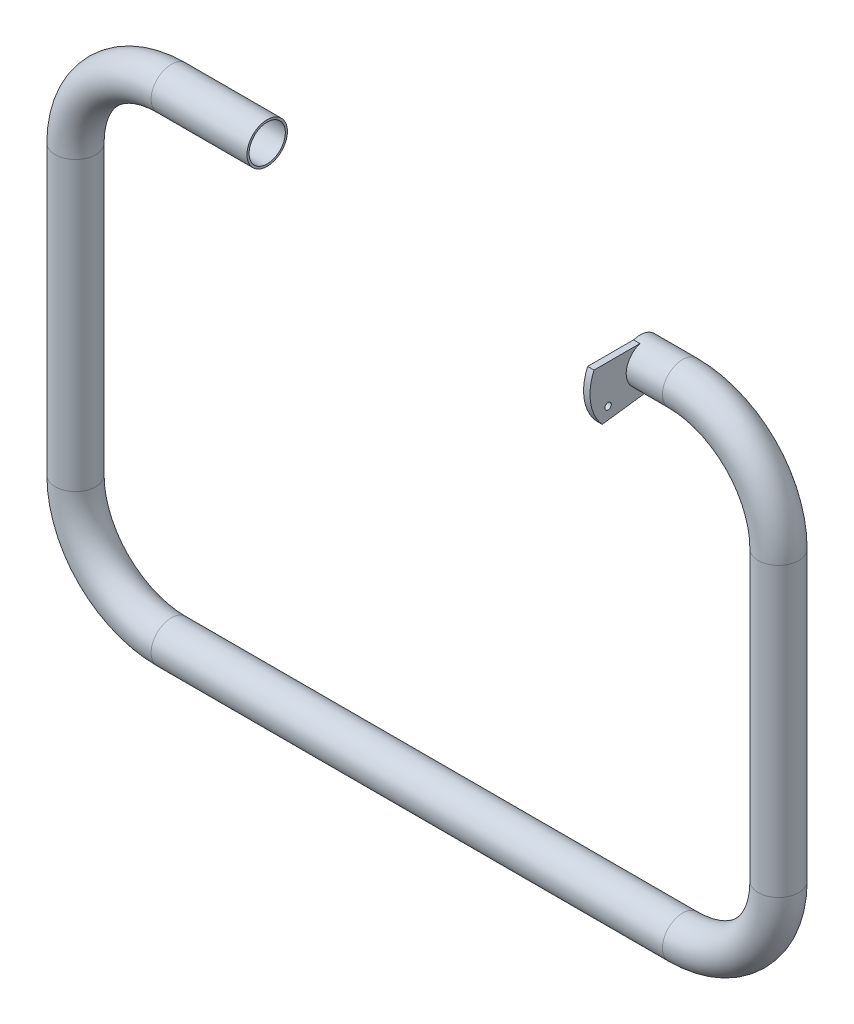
ISO-10303-21;
HEADER;
FILE_DESCRIPTION(('STEP AP214'),'2;1');
FILE_NAME('part.step','',(''),(''),'','','');
FILE_SCHEMA(('AUTOMOTIVE_DESIGN { 1 0 10303 214 1 1 1 1 }'));
ENDSEC;
DATA;
#1=APPLICATION_CONTEXT('core data for automotive mechanical design processes');
#2=APPLICATION_PROTOCOL_DEFINITION('international standard','automotive_design',2000,#1);
#3=PRODUCT_CONTEXT('',#1,'mechanical');
#4=PRODUCT('Part','Part','',(#3));
#5=PRODUCT_RELATED_PRODUCT_CATEGORY('part','',(#4));
#6=PRODUCT_DEFINITION_FORMATION('','',#4);
#7=PRODUCT_DEFINITION_CONTEXT('part definition',#1,'design');
#8=PRODUCT_DEFINITION('design','',#6,#7);
#9=PRODUCT_DEFINITION_SHAPE('','',#8);
#10=(LENGTH_UNIT() NAMED_UNIT(*) SI_UNIT(.MILLI.,.METRE.));
#11=(NAMED_UNIT(*) PLANE_ANGLE_UNIT() SI_UNIT($,.RADIAN.));
#12=(NAMED_UNIT(*) SI_UNIT($,.STERADIAN.) SOLID_ANGLE_UNIT());
#13=UNCERTAINTY_MEASURE_WITH_UNIT(LENGTH_MEASURE(1.E-05),#10,'distance_accuracy_value','');
#14=(GEOMETRIC_REPRESENTATION_CONTEXT(3) GLOBAL_UNCERTAINTY_ASSIGNED_CONTEXT((#13)) GLOBAL_UNIT_ASSIGNED_CONTEXT((#10,
#11,#12)) REPRESENTATION_CONTEXT('',''));
#15=CARTESIAN_POINT('',(0.,0.,0.));
#16=DIRECTION('',(0.,0.,1.));
#17=DIRECTION('',(1.,0.,0.));
#18=AXIS2_PLACEMENT_3D('',#15,#16,#17);
#19=CARTESIAN_POINT('',(-440.,0.,0.));
#20=DIRECTION('',(1.,0.,0.));
#21=DIRECTION('',(0.,1.,0.));
#22=AXIS2_PLACEMENT_3D('',#19,#20,#21);
#23=CYLINDRICAL_SURFACE('',#22,19.);
#24=CARTESIAN_POINT('',(-440.,0.,0.));
#25=DIRECTION('',(1.,0.,0.));
#26=DIRECTION('',(0.,1.,0.));
#27=AXIS2_PLACEMENT_3D('',#24,#25,#26);
#28=CIRCLE('',#27,19.);
#29=CARTESIAN_POINT('',(-440.,18.9999999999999,0.));
#30=VERTEX_POINT('',#29);
#31=EDGE_CURVE('E169',#30,#30,#28,.T.);
#32=ORIENTED_EDGE('',*,*,#31,.T.);
#33=EDGE_LOOP('',(#32));
#34=FACE_BOUND('',#33,.T.);
#35=CARTESIAN_POINT('',(-350.,0.,0.));
#36=DIRECTION('',(1.,0.,0.));
#37=DIRECTION('',(0.,1.,0.));
#38=AXIS2_PLACEMENT_3D('',#35,#36,#37);
#39=CIRCLE('',#38,19.);
#40=CARTESIAN_POINT('',(-350.,19.,0.));
#41=VERTEX_POINT('',#40);
#42=EDGE_CURVE('E41',#41,#41,#39,.T.);
#43=ORIENTED_EDGE('',*,*,#42,.F.);
#44=EDGE_LOOP('',(#43));
#45=FACE_BOUND('',#44,.T.);
#46=ADVANCED_FACE('F33',(#34,#45),#23,.T.);
#47=CARTESIAN_POINT('',(-440.,-90.,0.));
#48=DIRECTION('',(0.,0.,-1.));
#49=DIRECTION('',(-1.,0.,0.));
#50=AXIS2_PLACEMENT_3D('',#47,#48,#49);
#51=TOROIDAL_SURFACE('',#50,90.,19.);
#52=CARTESIAN_POINT('',(-530.000000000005,-90.0000000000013,0.));
#53=DIRECTION('',(0.,-1.,0.));
#54=DIRECTION('',(0.,0.,-1.));
#55=AXIS2_PLACEMENT_3D('',#52,#53,#54);
#56=CIRCLE('',#55,19.);
#57=CARTESIAN_POINT('',(-549.,-90.0000000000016,0.));
#58=VERTEX_POINT('',#57);
#59=EDGE_CURVE('E172',#58,#58,#56,.F.);
#60=CARTESIAN_POINT('',(-440.,-90.,0.));
#61=DIRECTION('',(0.,0.,-1.));
#62=DIRECTION('',(-1.,0.,0.));
#63=AXIS2_PLACEMENT_3D('',#60,#61,#62);
#64=CIRCLE('',#63,109.);
#65=EDGE_CURVE('',#58,#30,#64,.T.);
#66=ORIENTED_EDGE('',*,*,#59,.T.);
#67=ORIENTED_EDGE('',*,*,#31,.F.);
#68=ORIENTED_EDGE('',*,*,#65,.T.);
#69=ORIENTED_EDGE('',*,*,#65,.F.);
#70=EDGE_LOOP('',(#66,#68,#67,#69));
#71=FACE_BOUND('',#70,.T.);
#72=ADVANCED_FACE('F223',(#71),#51,.T.);
#73=CARTESIAN_POINT('',(-530.000000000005,-360.000000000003,0.));
#74=DIRECTION('',(0.,1.,0.));
#75=DIRECTION('',(-1.,0.,0.));
#76=AXIS2_PLACEMENT_3D('',#73,#74,#75);
#77=CYLINDRICAL_SURFACE('',#76,19.);
#78=CARTESIAN_POINT('',(-530.000000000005,-360.000000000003,0.));
#79=DIRECTION('',(0.,1.,0.));
#80=DIRECTION('',(-1.,0.,0.));
#81=AXIS2_PLACEMENT_3D('',#78,#79,#80);
#82=CIRCLE('',#81,19.);
#83=CARTESIAN_POINT('',(-549.,-360.000000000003,0.));
#84=VERTEX_POINT('',#83);
#85=EDGE_CURVE('E175',#84,#84,#82,.T.);
#86=ORIENTED_EDGE('',*,*,#85,.T.);
#87=EDGE_LOOP('',(#86));
#88=FACE_BOUND('',#87,.T.);
#89=ORIENTED_EDGE('',*,*,#59,.F.);
#90=EDGE_LOOP('',(#89));
#91=FACE_BOUND('',#90,.T.);
#92=ADVANCED_FACE('F229',(#88,#91),#77,.T.);
#93=CARTESIAN_POINT('',(-440.,-360.,0.));
#94=DIRECTION('',(0.,0.,-1.));
#95=DIRECTION('',(-1.,0.,0.));
#96=AXIS2_PLACEMENT_3D('',#93,#94,#95);
#97=TOROIDAL_SURFACE('',#96,90.,19.);
#98=CARTESIAN_POINT('',(-440.,-450.,0.));
#99=DIRECTION('',(1.,0.,0.));
#100=DIRECTION('',(0.,1.,0.));
#101=AXIS2_PLACEMENT_3D('',#98,#99,#100);
#102=CIRCLE('',#101,19.);
#103=CARTESIAN_POINT('',(-440.,-469.,0.));
#104=VERTEX_POINT('',#103);
#105=EDGE_CURVE('E178',#104,#104,#102,.F.);
#106=CARTESIAN_POINT('',(-440.,-360.,0.));
#107=DIRECTION('',(0.,0.,-1.));
#108=DIRECTION('',(-1.,0.,0.));
#109=AXIS2_PLACEMENT_3D('',#106,#107,#108);
#110=CIRCLE('',#109,109.);
#111=EDGE_CURVE('',#104,#84,#110,.T.);
#112=ORIENTED_EDGE('',*,*,#105,.T.);
#113=ORIENTED_EDGE('',*,*,#85,.F.);
#114=ORIENTED_EDGE('',*,*,#111,.T.);
#115=ORIENTED_EDGE('',*,*,#111,.F.);
#116=EDGE_LOOP('',(#112,#114,#113,#115));
#117=FACE_BOUND('',#116,.T.);
#118=ADVANCED_FACE('F239',(#117),#97,.T.);
#119=CARTESIAN_POINT('',(40.,-450.,3.46944695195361E-13));
#120=DIRECTION('',(-1.,0.,0.));
#121=DIRECTION('',(0.,-1.,0.));
#122=AXIS2_PLACEMENT_3D('',#119,#120,#121);
#123=CYLINDRICAL_SURFACE('',#122,19.);
#124=CARTESIAN_POINT('',(40.,-450.,3.46944695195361E-13));
#125=DIRECTION('',(-1.,0.,0.));
#126=DIRECTION('',(0.,-1.,0.));
#127=AXIS2_PLACEMENT_3D('',#124,#125,#126);
#128=CIRCLE('',#127,19.);
#129=CARTESIAN_POINT('',(40.0000000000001,-469.,3.52804205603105E-13));
#130=VERTEX_POINT('',#129);
#131=EDGE_CURVE('E181',#130,#130,#128,.T.);
#132=ORIENTED_EDGE('',*,*,#131,.T.);
#133=EDGE_LOOP('',(#132));
#134=FACE_BOUND('',#133,.T.);
#135=ORIENTED_EDGE('',*,*,#105,.F.);
#136=EDGE_LOOP('',(#135));
#137=FACE_BOUND('',#136,.T.);
#138=ADVANCED_FACE('F243',(#134,#137),#123,.T.);
#139=CARTESIAN_POINT('',(39.9999999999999,-360.,3.19189119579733E-13));
#140=DIRECTION('',(0.,0.,-1.));
#141=DIRECTION('',(-1.,0.,0.));
#142=AXIS2_PLACEMENT_3D('',#139,#140,#141);
#143=TOROIDAL_SURFACE('',#142,90.,19.);
#144=CARTESIAN_POINT('',(130.,-360.000000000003,3.46944695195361E-13));
#145=DIRECTION('',(0.,1.,0.));
#146=DIRECTION('',(-1.,0.,0.));
#147=AXIS2_PLACEMENT_3D('',#144,#145,#146);
#148=CIRCLE('',#147,19.);
#149=CARTESIAN_POINT('',(149.,-360.000000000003,3.52804205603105E-13));
#150=VERTEX_POINT('',#149);
#151=EDGE_CURVE('E184',#150,#150,#148,.F.);
#152=CARTESIAN_POINT('',(39.9999999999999,-360.,3.19189119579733E-13));
#153=DIRECTION('',(0.,0.,-1.));
#154=DIRECTION('',(-1.,0.,0.));
#155=AXIS2_PLACEMENT_3D('',#152,#153,#154);
#156=CIRCLE('',#155,109.);
#157=EDGE_CURVE('',#150,#130,#156,.T.);
#158=ORIENTED_EDGE('',*,*,#151,.T.);
#159=ORIENTED_EDGE('',*,*,#131,.F.);
#160=ORIENTED_EDGE('',*,*,#157,.T.);
#161=ORIENTED_EDGE('',*,*,#157,.F.);
#162=EDGE_LOOP('',(#158,#160,#159,#161));
#163=FACE_BOUND('',#162,.T.);
#164=ADVANCED_FACE('F247',(#163),#143,.T.);
#165=CARTESIAN_POINT('',(130.,-90.0000000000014,0.));
#166=DIRECTION('',(0.,-1.,0.));
#167=DIRECTION('',(1.,0.,0.));
#168=AXIS2_PLACEMENT_3D('',#165,#166,#167);
#169=CYLINDRICAL_SURFACE('',#168,19.);
#170=CARTESIAN_POINT('',(130.,-90.0000000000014,0.));
#171=DIRECTION('',(0.,-1.,0.));
#172=DIRECTION('',(1.,0.,0.));
#173=AXIS2_PLACEMENT_3D('',#170,#171,#172);
#174=CIRCLE('',#173,19.);
#175=CARTESIAN_POINT('',(149.,-90.0000000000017,0.));
#176=VERTEX_POINT('',#175);
#177=EDGE_CURVE('E187',#176,#176,#174,.T.);
#178=ORIENTED_EDGE('',*,*,#177,.T.);
#179=EDGE_LOOP('',(#178));
#180=FACE_BOUND('',#179,.T.);
#181=ORIENTED_EDGE('',*,*,#151,.F.);
#182=EDGE_LOOP('',(#181));
#183=FACE_BOUND('',#182,.T.);
#184=ADVANCED_FACE('F251',(#180,#183),#169,.T.);
#185=CARTESIAN_POINT('',(39.9999999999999,-90.,0.));
#186=DIRECTION('',(0.,0.,-1.));
#187=DIRECTION('',(-1.,0.,0.));
#188=AXIS2_PLACEMENT_3D('',#185,#186,#187);
#189=TOROIDAL_SURFACE('',#188,90.,19.);
#190=CARTESIAN_POINT('',(40.,0.,0.));
#191=DIRECTION('',(-1.,0.,0.));
#192=DIRECTION('',(0.,-1.,0.));
#193=AXIS2_PLACEMENT_3D('',#190,#191,#192);
#194=CIRCLE('',#193,19.);
#195=CARTESIAN_POINT('',(40.0000000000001,19.,0.));
#196=VERTEX_POINT('',#195);
#197=EDGE_CURVE('E190',#196,#196,#194,.F.);
#198=CARTESIAN_POINT('',(39.9999999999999,-90.,0.));
#199=DIRECTION('',(0.,0.,-1.));
#200=DIRECTION('',(-1.,0.,0.));
#201=AXIS2_PLACEMENT_3D('',#198,#199,#200);
#202=CIRCLE('',#201,109.);
#203=EDGE_CURVE('',#196,#176,#202,.T.);
#204=ORIENTED_EDGE('',*,*,#197,.T.);
#205=ORIENTED_EDGE('',*,*,#177,.F.);
#206=ORIENTED_EDGE('',*,*,#203,.T.);
#207=ORIENTED_EDGE('',*,*,#203,.F.);
#208=EDGE_LOOP('',(#204,#206,#205,#207));
#209=FACE_BOUND('',#208,.T.);
#210=ADVANCED_FACE('F254',(#209),#189,.T.);
#211=CARTESIAN_POINT('',(40.,0.,0.));
#212=DIRECTION('',(-1.,0.,0.));
#213=DIRECTION('',(0.,0.,1.));
#214=AXIS2_PLACEMENT_3D('',#211,#212,#213);
#215=CYLINDRICAL_SURFACE('',#214,19.);
#216=ORIENTED_EDGE('',*,*,#197,.F.);
#217=EDGE_LOOP('',(#216));
#218=FACE_BOUND('',#217,.T.);
#219=CARTESIAN_POINT('',(6.00000000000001,0.,0.));
#220=DIRECTION('',(-1.,0.,0.));
#221=DIRECTION('',(0.,0.,1.));
#222=AXIS2_PLACEMENT_3D('',#219,#220,#221);
#223=CIRCLE('',#222,19.);
#224=CARTESIAN_POINT('',(5.99999999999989,0.,-19.));
#225=VERTEX_POINT('',#224);
#226=CARTESIAN_POINT('',(6.00000000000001,17.9999999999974,6.08276253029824));
#227=VERTEX_POINT('',#226);
#228=EDGE_CURVE('E11',#225,#227,#223,.T.);
#229=ORIENTED_EDGE('',*,*,#228,.F.);
#230=DIRECTION('',(-1.,0.,0.));
#231=VECTOR('',#230,1.);
#232=CARTESIAN_POINT('',(39.9999999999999,0.,-19.));
#233=LINE('',#232,#231);
#234=CARTESIAN_POINT('',(-1.11022302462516E-13,0.,-19.));
#235=VERTEX_POINT('',#234);
#236=EDGE_CURVE('E136',#225,#235,#233,.T.);
#237=ORIENTED_EDGE('',*,*,#236,.T.);
#238=CARTESIAN_POINT('',(0.,0.,0.));
#239=DIRECTION('',(1.,0.,0.));
#240=DIRECTION('',(0.,0.,-1.));
#241=AXIS2_PLACEMENT_3D('',#238,#239,#240);
#242=CIRCLE('',#241,19.);
#243=CARTESIAN_POINT('',(0.,18.,6.08276253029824));
#244=VERTEX_POINT('',#243);
#245=EDGE_CURVE('E168',#235,#244,#242,.T.);
#246=ORIENTED_EDGE('',*,*,#245,.T.);
#247=DIRECTION('',(-1.,0.,0.));
#248=VECTOR('',#247,1.);
#249=CARTESIAN_POINT('',(40.,17.9999999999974,6.08276253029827));
#250=LINE('',#249,#248);
#251=EDGE_CURVE('E48',#244,#227,#250,.F.);
#252=ORIENTED_EDGE('',*,*,#251,.T.);
#253=EDGE_LOOP('',(#229,#237,#246,#252));
#254=FACE_BOUND('',#253,.T.);
#255=ADVANCED_FACE('F35',(#218,#254),#215,.T.);
#256=CARTESIAN_POINT('',(-350.,0.,0.));
#257=DIRECTION('',(1.,0.,0.));
#258=DIRECTION('',(0.,0.,-1.));
#259=AXIS2_PLACEMENT_3D('',#256,#257,#258);
#260=PLANE('',#259);
#261=CARTESIAN_POINT('',(-350.,0.,0.));
#262=DIRECTION('',(1.,0.,0.));
#263=DIRECTION('',(0.,0.,-1.));
#264=AXIS2_PLACEMENT_3D('',#261,#262,#263);
#265=CIRCLE('',#264,17.);
#266=CARTESIAN_POINT('',(-350.,0.,-17.));
#267=VERTEX_POINT('',#266);
#268=EDGE_CURVE('E165',#267,#267,#265,.T.);
#269=ORIENTED_EDGE('',*,*,#268,.F.);
#270=EDGE_LOOP('',(#269));
#271=FACE_BOUND('',#270,.T.);
#272=ORIENTED_EDGE('',*,*,#42,.T.);
#273=EDGE_LOOP('',(#272));
#274=FACE_BOUND('',#273,.T.);
#275=ADVANCED_FACE('F234',(#271,#274),#260,.T.);
#276=CARTESIAN_POINT('',(0.,0.,0.));
#277=DIRECTION('',(1.,0.,0.));
#278=DIRECTION('',(0.,0.,-1.));
#279=AXIS2_PLACEMENT_3D('',#276,#277,#278);
#280=PLANE('',#279);
#281=CARTESIAN_POINT('',(0.,0.,0.));
#282=DIRECTION('',(1.,0.,0.));
#283=DIRECTION('',(0.,0.,-1.));
#284=AXIS2_PLACEMENT_3D('',#281,#282,#283);
#285=CIRCLE('',#284,17.);
#286=CARTESIAN_POINT('',(0.,0.,-17.));
#287=VERTEX_POINT('',#286);
#288=EDGE_CURVE('E138',#287,#287,#285,.T.);
#289=ORIENTED_EDGE('',*,*,#288,.T.);
#290=EDGE_LOOP('',(#289));
#291=FACE_BOUND('',#290,.T.);
#292=ORIENTED_EDGE('',*,*,#245,.F.);
#293=DIRECTION('',(0.,0.,-1.));
#294=VECTOR('',#293,1.);
#295=CARTESIAN_POINT('',(-1.11022302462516E-13,0.,-18.));
#296=LINE('',#295,#294);
#297=CARTESIAN_POINT('',(0.,0.,-19.5));
#298=VERTEX_POINT('',#297);
#299=EDGE_CURVE('E101',#235,#298,#296,.T.);
#300=ORIENTED_EDGE('',*,*,#299,.T.);
#301=DIRECTION('',(0.,-1.,0.));
#302=VECTOR('',#301,1.);
#303=CARTESIAN_POINT('',(0.,0.,-19.5));
#304=LINE('',#303,#302);
#305=CARTESIAN_POINT('',(-2.66453525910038E-12,-22.0000000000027,-19.5));
#306=VERTEX_POINT('',#305);
#307=EDGE_CURVE('E116',#298,#306,#304,.T.);
#308=ORIENTED_EDGE('',*,*,#307,.T.);
#309=DIRECTION('',(0.,-0.129948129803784,0.99152079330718));
#310=VECTOR('',#309,1.);
#311=CARTESIAN_POINT('',(-2.66453525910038E-12,-22.0000000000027,-19.5));
#312=LINE('',#311,#310);
#313=CARTESIAN_POINT('',(-1.11022302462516E-13,-30.0000000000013,41.5410196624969));
#314=VERTEX_POINT('',#313);
#315=EDGE_CURVE('E107',#306,#314,#312,.T.);
#316=ORIENTED_EDGE('',*,*,#315,.T.);
#317=CARTESIAN_POINT('',(0.,0.,7.99999999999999));
#318=DIRECTION('',(-1.,0.,0.));
#319=DIRECTION('',(0.,0.,1.));
#320=AXIS2_PLACEMENT_3D('',#317,#318,#319);
#321=CIRCLE('',#320,45.);
#322=CARTESIAN_POINT('',(0.,18.0000000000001,49.2431812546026));
#323=VERTEX_POINT('',#322);
#324=EDGE_CURVE('E87',#314,#323,#321,.T.);
#325=ORIENTED_EDGE('',*,*,#324,.T.);
#326=DIRECTION('',(0.,0.,-1.));
#327=VECTOR('',#326,1.);
#328=CARTESIAN_POINT('',(0.,18.0000000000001,0.));
#329=LINE('',#328,#327);
#330=EDGE_CURVE('E98',#323,#244,#329,.T.);
#331=ORIENTED_EDGE('',*,*,#330,.T.);
#332=EDGE_LOOP('',(#292,#300,#308,#316,#325,#331));
#333=FACE_BOUND('',#332,.T.);
#334=CARTESIAN_POINT('',(0.,-18.0000000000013,36.));
#335=DIRECTION('',(-1.,0.,0.));
#336=DIRECTION('',(0.,0.,1.));
#337=AXIS2_PLACEMENT_3D('',#334,#335,#336);
#338=CIRCLE('',#337,3.);
#339=CARTESIAN_POINT('',(0.,-18.0000000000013,39.));
#340=VERTEX_POINT('',#339);
#341=EDGE_CURVE('E111',#340,#340,#338,.T.);
#342=ORIENTED_EDGE('',*,*,#341,.F.);
#343=EDGE_LOOP('',(#342));
#344=FACE_BOUND('',#343,.T.);
#345=ADVANCED_FACE('F103',(#291,#333,#344),#280,.F.);
#346=CARTESIAN_POINT('',(-440.,0.,0.));
#347=DIRECTION('',(1.,0.,0.));
#348=DIRECTION('',(0.,1.,0.));
#349=AXIS2_PLACEMENT_3D('',#346,#347,#348);
#350=CYLINDRICAL_SURFACE('',#349,17.);
#351=CARTESIAN_POINT('',(-440.,0.,0.));
#352=DIRECTION('',(1.,0.,0.));
#353=DIRECTION('',(0.,0.,-1.));
#354=AXIS2_PLACEMENT_3D('',#351,#352,#353);
#355=CIRCLE('',#354,17.);
#356=CARTESIAN_POINT('',(-440.,16.9999999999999,0.));
#357=VERTEX_POINT('',#356);
#358=EDGE_CURVE('E162',#357,#357,#355,.T.);
#359=ORIENTED_EDGE('',*,*,#358,.F.);
#360=EDGE_LOOP('',(#359));
#361=FACE_BOUND('',#360,.T.);
#362=ORIENTED_EDGE('',*,*,#268,.T.);
#363=EDGE_LOOP('',(#362));
#364=FACE_BOUND('',#363,.T.);
#365=ADVANCED_FACE('F284',(#361,#364),#350,.F.);
#366=CARTESIAN_POINT('',(-440.,-90.,0.));
#367=DIRECTION('',(0.,0.,-1.));
#368=DIRECTION('',(-1.,0.,0.));
#369=AXIS2_PLACEMENT_3D('',#366,#367,#368);
#370=TOROIDAL_SURFACE('',#369,90.,17.);
#371=CARTESIAN_POINT('',(-530.000000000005,-90.0000000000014,0.));
#372=DIRECTION('',(0.,1.,0.));
#373=DIRECTION('',(0.,0.,-1.));
#374=AXIS2_PLACEMENT_3D('',#371,#372,#373);
#375=CIRCLE('',#374,17.);
#376=CARTESIAN_POINT('',(-547.,-90.0000000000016,0.));
#377=VERTEX_POINT('',#376);
#378=EDGE_CURVE('E159',#377,#377,#375,.T.);
#379=CARTESIAN_POINT('',(-440.,-90.,0.));
#380=DIRECTION('',(0.,0.,-1.));
#381=DIRECTION('',(-1.,0.,0.));
#382=AXIS2_PLACEMENT_3D('',#379,#380,#381);
#383=CIRCLE('',#382,107.);
#384=EDGE_CURVE('',#377,#357,#383,.T.);
#385=ORIENTED_EDGE('',*,*,#378,.F.);
#386=ORIENTED_EDGE('',*,*,#358,.T.);
#387=ORIENTED_EDGE('',*,*,#384,.T.);
#388=ORIENTED_EDGE('',*,*,#384,.F.);
#389=EDGE_LOOP('',(#385,#387,#386,#388));
#390=FACE_BOUND('',#389,.T.);
#391=ADVANCED_FACE('F291',(#390),#370,.F.);
#392=CARTESIAN_POINT('',(-530.000000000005,-360.000000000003,0.));
#393=DIRECTION('',(0.,1.,0.));
#394=DIRECTION('',(-1.,0.,0.));
#395=AXIS2_PLACEMENT_3D('',#392,#393,#394);
#396=CYLINDRICAL_SURFACE('',#395,17.);
#397=CARTESIAN_POINT('',(-530.000000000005,-360.000000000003,0.));
#398=DIRECTION('',(0.,1.,0.));
#399=DIRECTION('',(0.,0.,-1.));
#400=AXIS2_PLACEMENT_3D('',#397,#398,#399);
#401=CIRCLE('',#400,17.);
#402=CARTESIAN_POINT('',(-547.,-360.000000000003,0.));
#403=VERTEX_POINT('',#402);
#404=EDGE_CURVE('E156',#403,#403,#401,.T.);
#405=ORIENTED_EDGE('',*,*,#404,.F.);
#406=EDGE_LOOP('',(#405));
#407=FACE_BOUND('',#406,.T.);
#408=ORIENTED_EDGE('',*,*,#378,.T.);
#409=EDGE_LOOP('',(#408));
#410=FACE_BOUND('',#409,.T.);
#411=ADVANCED_FACE('F297',(#407,#410),#396,.F.);
#412=CARTESIAN_POINT('',(-440.,-360.,0.));
#413=DIRECTION('',(0.,0.,-1.));
#414=DIRECTION('',(-1.,0.,0.));
#415=AXIS2_PLACEMENT_3D('',#412,#413,#414);
#416=TOROIDAL_SURFACE('',#415,90.,17.);
#417=CARTESIAN_POINT('',(-440.,-450.,0.));
#418=DIRECTION('',(-1.,0.,0.));
#419=DIRECTION('',(0.,0.,-1.));
#420=AXIS2_PLACEMENT_3D('',#417,#418,#419);
#421=CIRCLE('',#420,17.);
#422=CARTESIAN_POINT('',(-440.,-467.,0.));
#423=VERTEX_POINT('',#422);
#424=EDGE_CURVE('E153',#423,#423,#421,.T.);
#425=CARTESIAN_POINT('',(-440.,-360.,0.));
#426=DIRECTION('',(0.,0.,-1.));
#427=DIRECTION('',(-1.,0.,0.));
#428=AXIS2_PLACEMENT_3D('',#425,#426,#427);
#429=CIRCLE('',#428,107.);
#430=EDGE_CURVE('',#423,#403,#429,.T.);
#431=ORIENTED_EDGE('',*,*,#424,.F.);
#432=ORIENTED_EDGE('',*,*,#404,.T.);
#433=ORIENTED_EDGE('',*,*,#430,.T.);
#434=ORIENTED_EDGE('',*,*,#430,.F.);
#435=EDGE_LOOP('',(#431,#433,#432,#434));
#436=FACE_BOUND('',#435,.T.);
#437=ADVANCED_FACE('F304',(#436),#416,.F.);
#438=CARTESIAN_POINT('',(40.,-450.,3.46944695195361E-13));
#439=DIRECTION('',(-1.,0.,0.));
#440=DIRECTION('',(0.,-1.,0.));
#441=AXIS2_PLACEMENT_3D('',#438,#439,#440);
#442=CYLINDRICAL_SURFACE('',#441,17.);
#443=CARTESIAN_POINT('',(40.,-450.,3.46944695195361E-13));
#444=DIRECTION('',(-1.,0.,0.));
#445=DIRECTION('',(0.,0.,-1.));
#446=AXIS2_PLACEMENT_3D('',#443,#444,#445);
#447=CIRCLE('',#446,17.);
#448=CARTESIAN_POINT('',(40.0000000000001,-467.,3.52187415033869E-13));
#449=VERTEX_POINT('',#448);
#450=EDGE_CURVE('E150',#449,#449,#447,.T.);
#451=ORIENTED_EDGE('',*,*,#450,.F.);
#452=EDGE_LOOP('',(#451));
#453=FACE_BOUND('',#452,.T.);
#454=ORIENTED_EDGE('',*,*,#424,.T.);
#455=EDGE_LOOP('',(#454));
#456=FACE_BOUND('',#455,.T.);
#457=ADVANCED_FACE('F308',(#453,#456),#442,.F.);
#458=CARTESIAN_POINT('',(39.9999999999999,-360.,3.19189119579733E-13));
#459=DIRECTION('',(0.,0.,-1.));
#460=DIRECTION('',(-1.,0.,0.));
#461=AXIS2_PLACEMENT_3D('',#458,#459,#460);
#462=TOROIDAL_SURFACE('',#461,90.,17.);
#463=CARTESIAN_POINT('',(130.,-360.000000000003,3.46944695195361E-13));
#464=DIRECTION('',(0.,-1.,0.));
#465=DIRECTION('',(0.,0.,-1.));
#466=AXIS2_PLACEMENT_3D('',#463,#464,#465);
#467=CIRCLE('',#466,17.);
#468=CARTESIAN_POINT('',(147.,-360.000000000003,3.52187415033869E-13));
#469=VERTEX_POINT('',#468);
#470=EDGE_CURVE('E147',#469,#469,#467,.T.);
#471=CARTESIAN_POINT('',(39.9999999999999,-360.,3.19189119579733E-13));
#472=DIRECTION('',(0.,0.,-1.));
#473=DIRECTION('',(-1.,0.,0.));
#474=AXIS2_PLACEMENT_3D('',#471,#472,#473);
#475=CIRCLE('',#474,107.);
#476=EDGE_CURVE('',#469,#449,#475,.T.);
#477=ORIENTED_EDGE('',*,*,#470,.F.);
#478=ORIENTED_EDGE('',*,*,#450,.T.);
#479=ORIENTED_EDGE('',*,*,#476,.T.);
#480=ORIENTED_EDGE('',*,*,#476,.F.);
#481=EDGE_LOOP('',(#477,#479,#478,#480));
#482=FACE_BOUND('',#481,.T.);
#483=ADVANCED_FACE('F312',(#482),#462,.F.);
#484=CARTESIAN_POINT('',(130.,-90.0000000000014,0.));
#485=DIRECTION('',(0.,-1.,0.));
#486=DIRECTION('',(1.,0.,0.));
#487=AXIS2_PLACEMENT_3D('',#484,#485,#486);
#488=CYLINDRICAL_SURFACE('',#487,17.);
#489=CARTESIAN_POINT('',(130.,-90.0000000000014,0.));
#490=DIRECTION('',(0.,-1.,0.));
#491=DIRECTION('',(0.,0.,-1.));
#492=AXIS2_PLACEMENT_3D('',#489,#490,#491);
#493=CIRCLE('',#492,17.);
#494=CARTESIAN_POINT('',(147.,-90.0000000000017,0.));
#495=VERTEX_POINT('',#494);
#496=EDGE_CURVE('E144',#495,#495,#493,.T.);
#497=ORIENTED_EDGE('',*,*,#496,.F.);
#498=EDGE_LOOP('',(#497));
#499=FACE_BOUND('',#498,.T.);
#500=ORIENTED_EDGE('',*,*,#470,.T.);
#501=EDGE_LOOP('',(#500));
#502=FACE_BOUND('',#501,.T.);
#503=ADVANCED_FACE('F316',(#499,#502),#488,.F.);
#504=CARTESIAN_POINT('',(39.9999999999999,-90.,0.));
#505=DIRECTION('',(0.,0.,-1.));
#506=DIRECTION('',(-1.,0.,0.));
#507=AXIS2_PLACEMENT_3D('',#504,#505,#506);
#508=TOROIDAL_SURFACE('',#507,90.,17.);
#509=CARTESIAN_POINT('',(40.,0.,0.));
#510=DIRECTION('',(1.,0.,0.));
#511=DIRECTION('',(0.,0.,-1.));
#512=AXIS2_PLACEMENT_3D('',#509,#510,#511);
#513=CIRCLE('',#512,17.);
#514=CARTESIAN_POINT('',(40.0000000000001,17.,0.));
#515=VERTEX_POINT('',#514);
#516=EDGE_CURVE('E141',#515,#515,#513,.T.);
#517=CARTESIAN_POINT('',(39.9999999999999,-90.,0.));
#518=DIRECTION('',(0.,0.,-1.));
#519=DIRECTION('',(-1.,0.,0.));
#520=AXIS2_PLACEMENT_3D('',#517,#518,#519);
#521=CIRCLE('',#520,107.);
#522=EDGE_CURVE('',#515,#495,#521,.T.);
#523=ORIENTED_EDGE('',*,*,#516,.F.);
#524=ORIENTED_EDGE('',*,*,#496,.T.);
#525=ORIENTED_EDGE('',*,*,#522,.T.);
#526=ORIENTED_EDGE('',*,*,#522,.F.);
#527=EDGE_LOOP('',(#523,#525,#524,#526));
#528=FACE_BOUND('',#527,.T.);
#529=ADVANCED_FACE('F217',(#528),#508,.F.);
#530=CARTESIAN_POINT('',(40.,0.,0.));
#531=DIRECTION('',(-1.,0.,0.));
#532=DIRECTION('',(0.,0.,1.));
#533=AXIS2_PLACEMENT_3D('',#530,#531,#532);
#534=CYLINDRICAL_SURFACE('',#533,17.);
#535=ORIENTED_EDGE('',*,*,#516,.T.);
#536=EDGE_LOOP('',(#535));
#537=FACE_BOUND('',#536,.T.);
#538=ORIENTED_EDGE('',*,*,#288,.F.);
#539=EDGE_LOOP('',(#538));
#540=FACE_BOUND('',#539,.T.);
#541=ADVANCED_FACE('F209',(#537,#540),#534,.F.);
#542=CARTESIAN_POINT('',(6.00000000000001,-2.66453525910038E-12,8.00000000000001));
#543=DIRECTION('',(-1.,0.,0.));
#544=DIRECTION('',(0.,0.,1.));
#545=AXIS2_PLACEMENT_3D('',#542,#543,#544);
#546=PLANE('',#545);
#547=CARTESIAN_POINT('',(6.00000000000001,-18.0000000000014,36.));
#548=DIRECTION('',(-1.,0.,0.));
#549=DIRECTION('',(0.,0.,1.));
#550=AXIS2_PLACEMENT_3D('',#547,#548,#549);
#551=CIRCLE('',#550,3.);
#552=CARTESIAN_POINT('',(6.00000000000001,-18.0000000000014,39.));
#553=VERTEX_POINT('',#552);
#554=EDGE_CURVE('E108',#553,#553,#551,.T.);
#555=ORIENTED_EDGE('',*,*,#554,.T.);
#556=EDGE_LOOP('',(#555));
#557=FACE_BOUND('',#556,.T.);
#558=DIRECTION('',(0.,0.,-1.));
#559=VECTOR('',#558,1.);
#560=CARTESIAN_POINT('',(5.99999999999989,0.,-18.));
#561=LINE('',#560,#559);
#562=CARTESIAN_POINT('',(6.00000000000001,0.,-19.5));
#563=VERTEX_POINT('',#562);
#564=EDGE_CURVE('E122',#225,#563,#561,.T.);
#565=ORIENTED_EDGE('',*,*,#564,.F.);
#566=ORIENTED_EDGE('',*,*,#228,.T.);
#567=DIRECTION('',(0.,0.,-1.));
#568=VECTOR('',#567,1.);
#569=CARTESIAN_POINT('',(6.00000000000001,18.,0.));
#570=LINE('',#569,#568);
#571=CARTESIAN_POINT('',(6.00000000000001,18.0000000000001,49.2431812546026));
#572=VERTEX_POINT('',#571);
#573=EDGE_CURVE('E120',#572,#227,#570,.T.);
#574=ORIENTED_EDGE('',*,*,#573,.F.);
#575=CARTESIAN_POINT('',(6.00000000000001,-2.66453525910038E-12,8.00000000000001));
#576=DIRECTION('',(-1.,0.,0.));
#577=DIRECTION('',(0.,0.,1.));
#578=AXIS2_PLACEMENT_3D('',#575,#576,#577);
#579=CIRCLE('',#578,45.);
#580=CARTESIAN_POINT('',(5.99999999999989,-30.0000000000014,41.5410196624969));
#581=VERTEX_POINT('',#580);
#582=EDGE_CURVE('E90',#581,#572,#579,.T.);
#583=ORIENTED_EDGE('',*,*,#582,.F.);
#584=DIRECTION('',(0.,-0.129948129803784,0.99152079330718));
#585=VECTOR('',#584,1.);
#586=CARTESIAN_POINT('',(5.99999999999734,-22.0000000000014,-19.5));
#587=LINE('',#586,#585);
#588=CARTESIAN_POINT('',(5.99999999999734,-22.0000000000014,-19.5));
#589=VERTEX_POINT('',#588);
#590=EDGE_CURVE('E95',#589,#581,#587,.T.);
#591=ORIENTED_EDGE('',*,*,#590,.F.);
#592=DIRECTION('',(0.,-1.,0.));
#593=VECTOR('',#592,1.);
#594=CARTESIAN_POINT('',(6.00000000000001,0.,-19.5));
#595=LINE('',#594,#593);
#596=EDGE_CURVE('E124',#563,#589,#595,.T.);
#597=ORIENTED_EDGE('',*,*,#596,.F.);
#598=EDGE_LOOP('',(#565,#566,#574,#583,#591,#597));
#599=FACE_BOUND('',#598,.T.);
#600=ADVANCED_FACE('F207',(#557,#599),#546,.F.);
#601=CARTESIAN_POINT('',(5.99999999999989,0.,-18.));
#602=DIRECTION('',(0.,1.,0.));
#603=DIRECTION('',(0.,0.,1.));
#604=AXIS2_PLACEMENT_3D('',#601,#602,#603);
#605=PLANE('',#604);
#606=ORIENTED_EDGE('',*,*,#236,.F.);
#607=ORIENTED_EDGE('',*,*,#564,.T.);
#608=DIRECTION('',(-1.,0.,0.));
#609=VECTOR('',#608,1.);
#610=CARTESIAN_POINT('',(6.00000000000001,0.,-19.5));
#611=LINE('',#610,#609);
#612=EDGE_CURVE('E94',#563,#298,#611,.T.);
#613=ORIENTED_EDGE('',*,*,#612,.T.);
#614=ORIENTED_EDGE('',*,*,#299,.F.);
#615=EDGE_LOOP('',(#606,#607,#613,#614));
#616=FACE_BOUND('',#615,.T.);
#617=ADVANCED_FACE('F198',(#616),#605,.T.);
#618=CARTESIAN_POINT('',(6.00000000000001,18.,0.));
#619=DIRECTION('',(0.,1.,0.));
#620=DIRECTION('',(0.,0.,1.));
#621=AXIS2_PLACEMENT_3D('',#618,#619,#620);
#622=PLANE('',#621);
#623=ORIENTED_EDGE('',*,*,#251,.F.);
#624=ORIENTED_EDGE('',*,*,#330,.F.);
#625=DIRECTION('',(-1.,0.,0.));
#626=VECTOR('',#625,1.);
#627=CARTESIAN_POINT('',(6.00000000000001,18.0000000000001,49.2431812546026));
#628=LINE('',#627,#626);
#629=EDGE_CURVE('E83',#572,#323,#628,.T.);
#630=ORIENTED_EDGE('',*,*,#629,.F.);
#631=ORIENTED_EDGE('',*,*,#573,.T.);
#632=EDGE_LOOP('',(#623,#624,#630,#631));
#633=FACE_BOUND('',#632,.T.);
#634=ADVANCED_FACE('F99',(#633),#622,.T.);
#635=CARTESIAN_POINT('',(6.00000000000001,-2.66453525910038E-12,8.00000000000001));
#636=DIRECTION('',(-1.,0.,0.));
#637=DIRECTION('',(0.,0.,1.));
#638=AXIS2_PLACEMENT_3D('',#635,#636,#637);
#639=CYLINDRICAL_SURFACE('',#638,45.);
#640=ORIENTED_EDGE('',*,*,#324,.F.);
#641=DIRECTION('',(-1.,0.,0.));
#642=VECTOR('',#641,1.);
#643=CARTESIAN_POINT('',(5.99999999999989,-30.0000000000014,41.5410196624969));
#644=LINE('',#643,#642);
#645=EDGE_CURVE('E129',#581,#314,#644,.T.);
#646=ORIENTED_EDGE('',*,*,#645,.F.);
#647=ORIENTED_EDGE('',*,*,#582,.T.);
#648=ORIENTED_EDGE('',*,*,#629,.T.);
#649=EDGE_LOOP('',(#640,#646,#647,#648));
#650=FACE_BOUND('',#649,.T.);
#651=ADVANCED_FACE('F85',(#650),#639,.T.);
#652=CARTESIAN_POINT('',(5.99999999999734,-22.0000000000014,-19.5));
#653=DIRECTION('',(0.,-0.99152079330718,-0.129948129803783));
#654=DIRECTION('',(0.,0.129948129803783,-0.99152079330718));
#655=AXIS2_PLACEMENT_3D('',#652,#653,#654);
#656=PLANE('',#655);
#657=ORIENTED_EDGE('',*,*,#315,.F.);
#658=DIRECTION('',(-1.,0.,0.));
#659=VECTOR('',#658,1.);
#660=CARTESIAN_POINT('',(5.99999999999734,-22.0000000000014,-19.5));
#661=LINE('',#660,#659);
#662=EDGE_CURVE('E131',#589,#306,#661,.T.);
#663=ORIENTED_EDGE('',*,*,#662,.F.);
#664=ORIENTED_EDGE('',*,*,#590,.T.);
#665=ORIENTED_EDGE('',*,*,#645,.T.);
#666=EDGE_LOOP('',(#657,#663,#664,#665));
#667=FACE_BOUND('',#666,.T.);
#668=ADVANCED_FACE('F205',(#667),#656,.T.);
#669=CARTESIAN_POINT('',(6.00000000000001,0.,-19.5));
#670=DIRECTION('',(0.,0.,-1.));
#671=DIRECTION('',(0.,1.,0.));
#672=AXIS2_PLACEMENT_3D('',#669,#670,#671);
#673=PLANE('',#672);
#674=ORIENTED_EDGE('',*,*,#307,.F.);
#675=ORIENTED_EDGE('',*,*,#612,.F.);
#676=ORIENTED_EDGE('',*,*,#596,.T.);
#677=ORIENTED_EDGE('',*,*,#662,.T.);
#678=EDGE_LOOP('',(#674,#675,#676,#677));
#679=FACE_BOUND('',#678,.T.);
#680=ADVANCED_FACE('F202',(#679),#673,.T.);
#681=CARTESIAN_POINT('',(6.00000000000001,-18.0000000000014,36.));
#682=DIRECTION('',(-1.,0.,0.));
#683=DIRECTION('',(0.,0.,1.));
#684=AXIS2_PLACEMENT_3D('',#681,#682,#683);
#685=CYLINDRICAL_SURFACE('',#684,3.);
#686=ORIENTED_EDGE('',*,*,#554,.F.);
#687=EDGE_LOOP('',(#686));
#688=FACE_BOUND('',#687,.T.);
#689=ORIENTED_EDGE('',*,*,#341,.T.);
#690=EDGE_LOOP('',(#689));
#691=FACE_BOUND('',#690,.T.);
#692=ADVANCED_FACE('F329',(#688,#691),#685,.F.);
#693=CLOSED_SHELL('',(#46,#72,#92,#118,#138,#164,#184,#210,#255,#275,#345,#365,#391,#411,#437,
#457,#483,#503,#529,#541,#600,#617,#634,#651,#668,#680,#692));
#694=MANIFOLD_SOLID_BREP('B2',#693);
#695=ADVANCED_BREP_SHAPE_REPRESENTATION('',(#18,#694),#14);
#696=SHAPE_DEFINITION_REPRESENTATION(#9,#695);
ENDSEC;
END-ISO-10303-21;
